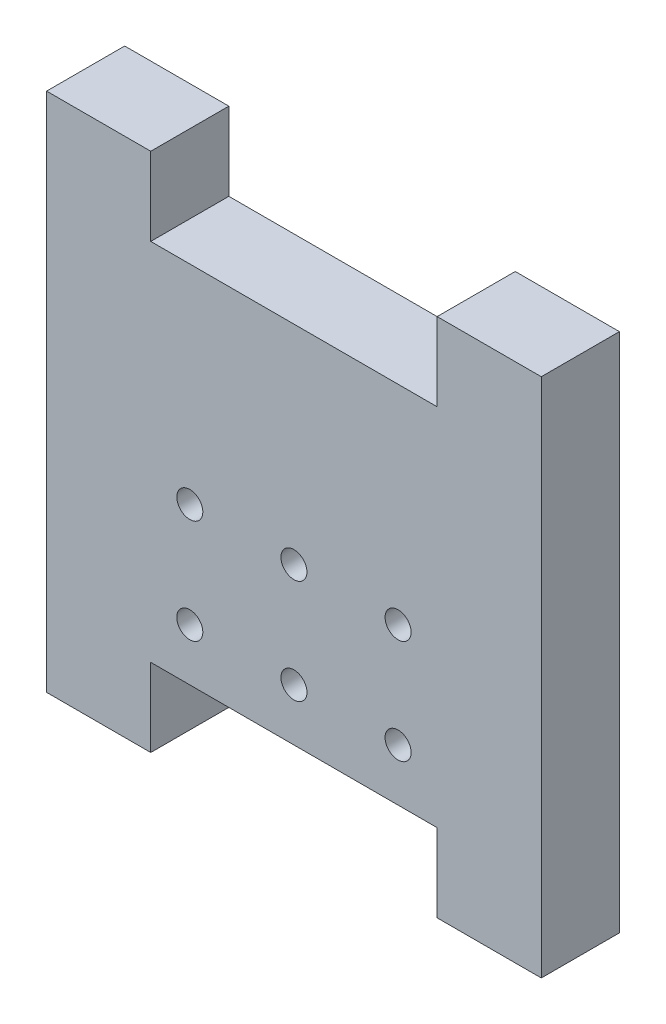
from build123d import *

# Parameters (mm, degrees)
BOSS_EXTRUDE1_DEPTH = 19.05
CUT_EXTRUDE1_REACH  = 166.741
SKETCH2_R           = 3.175


with BuildPart() as part:
    # Sketch1 → Boss-Extrude1 (new body)
    with BuildSketch(Plane.XY):
        Polygon((-17.4625, 0), (7.9375, 0), (7.9375, 19.05), (77.7875, 19.05), (77.7875, 0), (103.1875, 0), (103.1875, 127), (77.7875, 127), (77.7875, 107.95), (7.9375, 107.95), (7.9375, 127), (-17.4625, 127), align=None)
    extrude(amount=BOSS_EXTRUDE1_DEPTH)

    # Sketch2 → Cut-Extrude1 (cut, up to next)
    with BuildSketch(Plane.XY.offset(19.05), mode=Mode.PRIVATE) as cut_extrude1_sk1:
        with Locations((68.2625, 57.15)):
            Circle(SKETCH2_R)
    cut_extrude1_tool1 = extrude(cut_extrude1_sk1.sketch, amount=-CUT_EXTRUDE1_REACH, mode=Mode.PRIVATE) & part.part
    # Sketch2 → Cut-Extrude1 (cut, up to next)
    with BuildSketch(Plane.XY.offset(19.05), mode=Mode.PRIVATE) as cut_extrude1_sk2:
        with Locations((42.8625, 31.75)):
            Circle(SKETCH2_R)
    cut_extrude1_tool2 = extrude(cut_extrude1_sk2.sketch, amount=-CUT_EXTRUDE1_REACH, mode=Mode.PRIVATE) & part.part
    # Sketch2 → Cut-Extrude1 (cut, up to next)
    with BuildSketch(Plane.XY.offset(19.05), mode=Mode.PRIVATE) as cut_extrude1_sk3:
        with Locations((17.4625, 31.75)):
            Circle(SKETCH2_R)
    cut_extrude1_tool3 = extrude(cut_extrude1_sk3.sketch, amount=-CUT_EXTRUDE1_REACH, mode=Mode.PRIVATE) & part.part
    # Sketch2 → Cut-Extrude1 (cut, up to next)
    with BuildSketch(Plane.XY.offset(19.05), mode=Mode.PRIVATE) as cut_extrude1_sk4:
        with Locations((17.4625, 57.15)):
            Circle(SKETCH2_R)
    cut_extrude1_tool4 = extrude(cut_extrude1_sk4.sketch, amount=-CUT_EXTRUDE1_REACH, mode=Mode.PRIVATE) & part.part
    # Sketch2 → Cut-Extrude1 (cut, up to next)
    with BuildSketch(Plane.XY.offset(19.05), mode=Mode.PRIVATE) as cut_extrude1_sk5:
        with Locations((42.8625, 57.15)):
            Circle(SKETCH2_R)
    cut_extrude1_tool5 = extrude(cut_extrude1_sk5.sketch, amount=-CUT_EXTRUDE1_REACH, mode=Mode.PRIVATE) & part.part
    # Sketch2 → Cut-Extrude1 (cut, up to next)
    with BuildSketch(Plane.XY.offset(19.05), mode=Mode.PRIVATE) as cut_extrude1_sk6:
        with Locations((68.2625, 31.75)):
            Circle(SKETCH2_R)
    cut_extrude1_tool6 = extrude(cut_extrude1_sk6.sketch, amount=-CUT_EXTRUDE1_REACH, mode=Mode.PRIVATE) & part.part
    add(cut_extrude1_tool1.solids().sort_by_distance((68.2625, 57.15, 19.05))[0], mode=Mode.SUBTRACT)
    add(cut_extrude1_tool2.solids().sort_by_distance((42.8625, 31.75, 19.05))[0], mode=Mode.SUBTRACT)
    add(cut_extrude1_tool3.solids().sort_by_distance((17.4625, 31.75, 19.05))[0], mode=Mode.SUBTRACT)
    add(cut_extrude1_tool4.solids().sort_by_distance((17.4625, 57.15, 19.05))[0], mode=Mode.SUBTRACT)
    add(cut_extrude1_tool5.solids().sort_by_distance((42.8625, 57.15, 19.05))[0], mode=Mode.SUBTRACT)
    add(cut_extrude1_tool6.solids().sort_by_distance((68.2625, 31.75, 19.05))[0], mode=Mode.SUBTRACT)


solid = part.part
